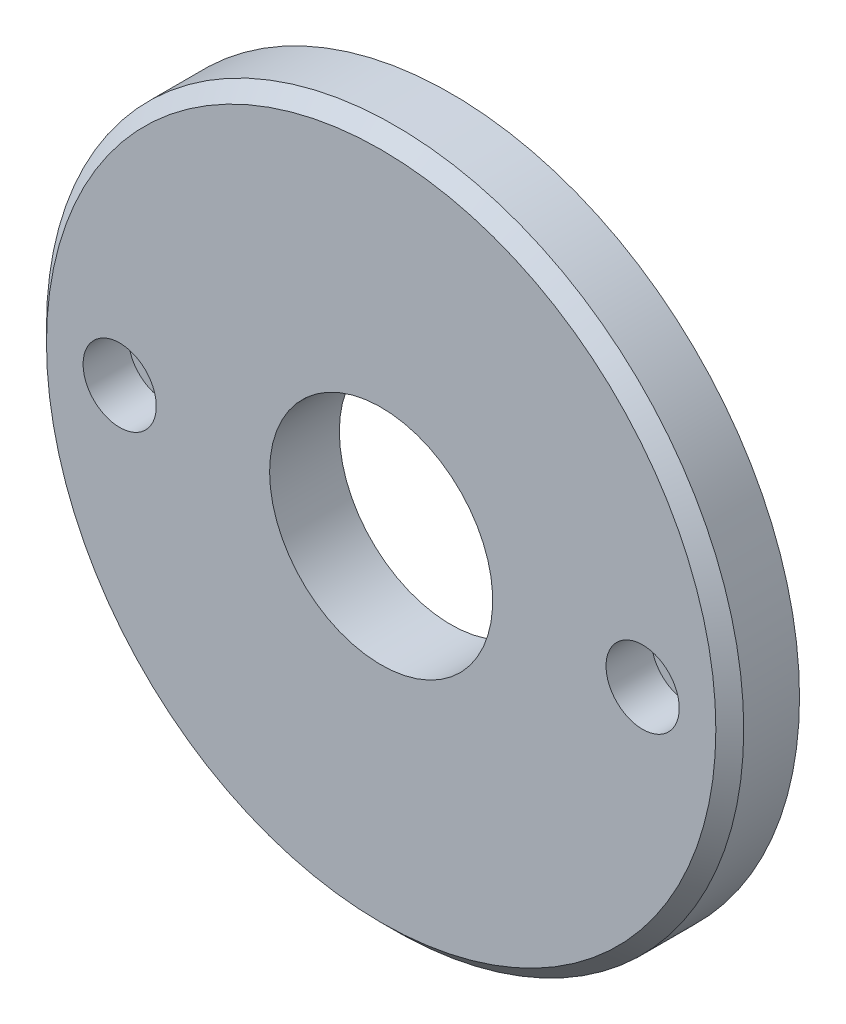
ISO-10303-21;
HEADER;
FILE_DESCRIPTION(('STEP AP214'),'2;1');
FILE_NAME('part.step','',(''),(''),'','','');
FILE_SCHEMA(('AUTOMOTIVE_DESIGN { 1 0 10303 214 1 1 1 1 }'));
ENDSEC;
DATA;
#1=APPLICATION_CONTEXT('core data for automotive mechanical design processes');
#2=APPLICATION_PROTOCOL_DEFINITION('international standard','automotive_design',2000,#1);
#3=PRODUCT_CONTEXT('',#1,'mechanical');
#4=PRODUCT('Part','Part','',(#3));
#5=PRODUCT_RELATED_PRODUCT_CATEGORY('part','',(#4));
#6=PRODUCT_DEFINITION_FORMATION('','',#4);
#7=PRODUCT_DEFINITION_CONTEXT('part definition',#1,'design');
#8=PRODUCT_DEFINITION('design','',#6,#7);
#9=PRODUCT_DEFINITION_SHAPE('','',#8);
#10=(LENGTH_UNIT() NAMED_UNIT(*) SI_UNIT(.MILLI.,.METRE.));
#11=(NAMED_UNIT(*) PLANE_ANGLE_UNIT() SI_UNIT($,.RADIAN.));
#12=(NAMED_UNIT(*) SI_UNIT($,.STERADIAN.) SOLID_ANGLE_UNIT());
#13=UNCERTAINTY_MEASURE_WITH_UNIT(LENGTH_MEASURE(1.E-05),#10,'distance_accuracy_value','');
#14=(GEOMETRIC_REPRESENTATION_CONTEXT(3) GLOBAL_UNCERTAINTY_ASSIGNED_CONTEXT((#13)) GLOBAL_UNIT_ASSIGNED_CONTEXT((#10,
#11,#12)) REPRESENTATION_CONTEXT('',''));
#15=CARTESIAN_POINT('',(0.,0.,0.));
#16=DIRECTION('',(0.,0.,1.));
#17=DIRECTION('',(1.,0.,0.));
#18=AXIS2_PLACEMENT_3D('',#15,#16,#17);
#19=CARTESIAN_POINT('',(0.,0.,70.));
#20=DIRECTION('',(0.,0.,1.));
#21=DIRECTION('',(1.,0.,0.));
#22=AXIS2_PLACEMENT_3D('',#19,#20,#21);
#23=PLANE('',#22);
#24=CARTESIAN_POINT('',(37.5,0.,70.));
#25=DIRECTION('',(0.,0.,-1.));
#26=DIRECTION('',(1.,0.,0.));
#27=AXIS2_PLACEMENT_3D('',#24,#25,#26);
#28=CIRCLE('',#27,5.25);
#29=CARTESIAN_POINT('',(42.75,0.,70.));
#30=VERTEX_POINT('',#29);
#31=EDGE_CURVE('E111',#30,#30,#28,.T.);
#32=ORIENTED_EDGE('',*,*,#31,.T.);
#33=EDGE_LOOP('',(#32));
#34=FACE_BOUND('',#33,.T.);
#35=CARTESIAN_POINT('',(-37.5,0.,70.));
#36=DIRECTION('',(0.,0.,-1.));
#37=DIRECTION('',(-1.,0.,0.));
#38=AXIS2_PLACEMENT_3D('',#35,#36,#37);
#39=CIRCLE('',#38,5.25);
#40=CARTESIAN_POINT('',(-42.75,0.,70.));
#41=VERTEX_POINT('',#40);
#42=EDGE_CURVE('E45',#41,#41,#39,.T.);
#43=ORIENTED_EDGE('',*,*,#42,.T.);
#44=EDGE_LOOP('',(#43));
#45=FACE_BOUND('',#44,.T.);
#46=CARTESIAN_POINT('',(0.,0.,70.));
#47=DIRECTION('',(0.,0.,1.));
#48=DIRECTION('',(1.,0.,0.));
#49=AXIS2_PLACEMENT_3D('',#46,#47,#48);
#50=CIRCLE('',#49,48.);
#51=CARTESIAN_POINT('',(48.,0.,70.));
#52=VERTEX_POINT('',#51);
#53=EDGE_CURVE('E10',#52,#52,#50,.T.);
#54=ORIENTED_EDGE('',*,*,#53,.T.);
#55=EDGE_LOOP('',(#54));
#56=FACE_BOUND('',#55,.T.);
#57=CARTESIAN_POINT('',(0.,0.,70.));
#58=DIRECTION('',(0.,0.,-1.));
#59=DIRECTION('',(-1.,0.,0.));
#60=AXIS2_PLACEMENT_3D('',#57,#58,#59);
#61=CIRCLE('',#60,16.);
#62=CARTESIAN_POINT('',(-16.,0.,70.));
#63=VERTEX_POINT('',#62);
#64=EDGE_CURVE('E32',#63,#63,#61,.T.);
#65=ORIENTED_EDGE('',*,*,#64,.T.);
#66=EDGE_LOOP('',(#65));
#67=FACE_BOUND('',#66,.T.);
#68=ADVANCED_FACE('F14',(#34,#45,#56,#67),#23,.T.);
#69=CARTESIAN_POINT('',(0.,0.,60.));
#70=DIRECTION('',(0.,0.,-1.));
#71=DIRECTION('',(-1.,0.,0.));
#72=AXIS2_PLACEMENT_3D('',#69,#70,#71);
#73=PLANE('',#72);
#74=CARTESIAN_POINT('',(37.5,0.,60.));
#75=DIRECTION('',(0.,0.,-1.));
#76=DIRECTION('',(-1.,0.,0.));
#77=AXIS2_PLACEMENT_3D('',#74,#75,#76);
#78=CIRCLE('',#77,3.25);
#79=CARTESIAN_POINT('',(34.25,0.,60.));
#80=VERTEX_POINT('',#79);
#81=EDGE_CURVE('E18',#80,#80,#78,.T.);
#82=ORIENTED_EDGE('',*,*,#81,.F.);
#83=EDGE_LOOP('',(#82));
#84=FACE_BOUND('',#83,.T.);
#85=CARTESIAN_POINT('',(-37.5,0.,60.));
#86=DIRECTION('',(0.,0.,-1.));
#87=DIRECTION('',(-1.,0.,0.));
#88=AXIS2_PLACEMENT_3D('',#85,#86,#87);
#89=CIRCLE('',#88,3.25);
#90=CARTESIAN_POINT('',(-40.75,0.,60.));
#91=VERTEX_POINT('',#90);
#92=EDGE_CURVE('E30',#91,#91,#89,.T.);
#93=ORIENTED_EDGE('',*,*,#92,.F.);
#94=EDGE_LOOP('',(#93));
#95=FACE_BOUND('',#94,.T.);
#96=CARTESIAN_POINT('',(0.,0.,60.));
#97=DIRECTION('',(0.,0.,-1.));
#98=DIRECTION('',(-1.,0.,0.));
#99=AXIS2_PLACEMENT_3D('',#96,#97,#98);
#100=CIRCLE('',#99,16.);
#101=CARTESIAN_POINT('',(-16.,0.,60.));
#102=VERTEX_POINT('',#101);
#103=EDGE_CURVE('E37',#102,#102,#100,.T.);
#104=ORIENTED_EDGE('',*,*,#103,.F.);
#105=EDGE_LOOP('',(#104));
#106=FACE_BOUND('',#105,.T.);
#107=CARTESIAN_POINT('',(0.,0.,60.));
#108=DIRECTION('',(0.,0.,1.));
#109=DIRECTION('',(1.,0.,0.));
#110=AXIS2_PLACEMENT_3D('',#107,#108,#109);
#111=CIRCLE('',#110,50.);
#112=CARTESIAN_POINT('',(50.,0.,60.));
#113=VERTEX_POINT('',#112);
#114=EDGE_CURVE('E27',#113,#113,#111,.T.);
#115=ORIENTED_EDGE('',*,*,#114,.F.);
#116=EDGE_LOOP('',(#115));
#117=FACE_BOUND('',#116,.T.);
#118=ADVANCED_FACE('F56',(#84,#95,#106,#117),#73,.T.);
#119=CARTESIAN_POINT('',(0.,0.,60.));
#120=DIRECTION('',(0.,0.,1.));
#121=DIRECTION('',(1.,0.,0.));
#122=AXIS2_PLACEMENT_3D('',#119,#120,#121);
#123=CYLINDRICAL_SURFACE('',#122,50.);
#124=CARTESIAN_POINT('',(0.,0.,68.));
#125=DIRECTION('',(0.,0.,1.));
#126=DIRECTION('',(1.,0.,0.));
#127=AXIS2_PLACEMENT_3D('',#124,#125,#126);
#128=CIRCLE('',#127,50.);
#129=CARTESIAN_POINT('',(50.,0.,68.));
#130=VERTEX_POINT('',#129);
#131=EDGE_CURVE('E22',#130,#130,#128,.F.);
#132=ORIENTED_EDGE('',*,*,#131,.T.);
#133=EDGE_LOOP('',(#132));
#134=FACE_BOUND('',#133,.T.);
#135=ORIENTED_EDGE('',*,*,#114,.T.);
#136=EDGE_LOOP('',(#135));
#137=FACE_BOUND('',#136,.T.);
#138=ADVANCED_FACE('F59',(#134,#137),#123,.T.);
#139=CARTESIAN_POINT('',(0.,0.,70.));
#140=DIRECTION('',(0.,0.,-1.));
#141=DIRECTION('',(-1.,0.,0.));
#142=AXIS2_PLACEMENT_3D('',#139,#140,#141);
#143=CYLINDRICAL_SURFACE('',#142,16.);
#144=ORIENTED_EDGE('',*,*,#103,.T.);
#145=EDGE_LOOP('',(#144));
#146=FACE_BOUND('',#145,.T.);
#147=ORIENTED_EDGE('',*,*,#64,.F.);
#148=EDGE_LOOP('',(#147));
#149=FACE_BOUND('',#148,.T.);
#150=ADVANCED_FACE('F53',(#146,#149),#143,.F.);
#151=CARTESIAN_POINT('',(0.,0.,68.));
#152=DIRECTION('',(0.,0.,-1.));
#153=DIRECTION('',(-1.,0.,0.));
#154=AXIS2_PLACEMENT_3D('',#151,#152,#153);
#155=CONICAL_SURFACE('',#154,50.,0.785398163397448);
#156=ORIENTED_EDGE('',*,*,#53,.F.);
#157=EDGE_LOOP('',(#156));
#158=FACE_BOUND('',#157,.T.);
#159=ORIENTED_EDGE('',*,*,#131,.F.);
#160=EDGE_LOOP('',(#159));
#161=FACE_BOUND('',#160,.T.);
#162=ADVANCED_FACE('F16',(#158,#161),#155,.T.);
#163=CARTESIAN_POINT('',(-37.5,0.,-256.997323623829));
#164=DIRECTION('',(0.,0.,-1.));
#165=DIRECTION('',(-1.,0.,0.));
#166=AXIS2_PLACEMENT_3D('',#163,#164,#165);
#167=CYLINDRICAL_SURFACE('',#166,3.25);
#168=ORIENTED_EDGE('',*,*,#92,.T.);
#169=EDGE_LOOP('',(#168));
#170=FACE_BOUND('',#169,.T.);
#171=CARTESIAN_POINT('',(-37.5,0.,63.5));
#172=DIRECTION('',(0.,0.,-1.));
#173=DIRECTION('',(-1.,0.,0.));
#174=AXIS2_PLACEMENT_3D('',#171,#172,#173);
#175=CIRCLE('',#174,3.25);
#176=CARTESIAN_POINT('',(-40.75,0.,63.5));
#177=VERTEX_POINT('',#176);
#178=EDGE_CURVE('E33',#177,#177,#175,.T.);
#179=ORIENTED_EDGE('',*,*,#178,.F.);
#180=EDGE_LOOP('',(#179));
#181=FACE_BOUND('',#180,.T.);
#182=ADVANCED_FACE('F87',(#170,#181),#167,.F.);
#183=CARTESIAN_POINT('',(-37.5,0.,63.5));
#184=DIRECTION('',(0.,0.,-1.));
#185=DIRECTION('',(-1.,0.,0.));
#186=AXIS2_PLACEMENT_3D('',#183,#184,#185);
#187=PLANE('',#186);
#188=ORIENTED_EDGE('',*,*,#178,.T.);
#189=EDGE_LOOP('',(#188));
#190=FACE_BOUND('',#189,.T.);
#191=CARTESIAN_POINT('',(-37.5,0.,63.5));
#192=DIRECTION('',(0.,0.,-1.));
#193=DIRECTION('',(-1.,0.,0.));
#194=AXIS2_PLACEMENT_3D('',#191,#192,#193);
#195=CIRCLE('',#194,5.25);
#196=CARTESIAN_POINT('',(-42.75,0.,63.5));
#197=VERTEX_POINT('',#196);
#198=EDGE_CURVE('E40',#197,#197,#195,.T.);
#199=ORIENTED_EDGE('',*,*,#198,.F.);
#200=EDGE_LOOP('',(#199));
#201=FACE_BOUND('',#200,.T.);
#202=ADVANCED_FACE('F83',(#190,#201),#187,.F.);
#203=CARTESIAN_POINT('',(-37.5,0.,70.));
#204=DIRECTION('',(0.,0.,-1.));
#205=DIRECTION('',(-1.,0.,0.));
#206=AXIS2_PLACEMENT_3D('',#203,#204,#205);
#207=CYLINDRICAL_SURFACE('',#206,5.25);
#208=ORIENTED_EDGE('',*,*,#198,.T.);
#209=EDGE_LOOP('',(#208));
#210=FACE_BOUND('',#209,.T.);
#211=ORIENTED_EDGE('',*,*,#42,.F.);
#212=EDGE_LOOP('',(#211));
#213=FACE_BOUND('',#212,.T.);
#214=ADVANCED_FACE('F79',(#210,#213),#207,.F.);
#215=CARTESIAN_POINT('',(37.5,0.,-256.997323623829));
#216=DIRECTION('',(0.,0.,-1.));
#217=DIRECTION('',(1.,0.,0.));
#218=AXIS2_PLACEMENT_3D('',#215,#216,#217);
#219=CYLINDRICAL_SURFACE('',#218,3.25);
#220=ORIENTED_EDGE('',*,*,#81,.T.);
#221=EDGE_LOOP('',(#220));
#222=FACE_BOUND('',#221,.T.);
#223=CARTESIAN_POINT('',(37.5,0.,63.5));
#224=DIRECTION('',(0.,0.,-1.));
#225=DIRECTION('',(1.,0.,0.));
#226=AXIS2_PLACEMENT_3D('',#223,#224,#225);
#227=CIRCLE('',#226,3.25);
#228=CARTESIAN_POINT('',(40.75,0.,63.5));
#229=VERTEX_POINT('',#228);
#230=EDGE_CURVE('E107',#229,#229,#227,.T.);
#231=ORIENTED_EDGE('',*,*,#230,.F.);
#232=EDGE_LOOP('',(#231));
#233=FACE_BOUND('',#232,.T.);
#234=ADVANCED_FACE('F82',(#222,#233),#219,.F.);
#235=CARTESIAN_POINT('',(37.5,0.,63.5));
#236=DIRECTION('',(0.,0.,-1.));
#237=DIRECTION('',(1.,0.,0.));
#238=AXIS2_PLACEMENT_3D('',#235,#236,#237);
#239=PLANE('',#238);
#240=ORIENTED_EDGE('',*,*,#230,.T.);
#241=EDGE_LOOP('',(#240));
#242=FACE_BOUND('',#241,.T.);
#243=CARTESIAN_POINT('',(37.5,0.,63.5));
#244=DIRECTION('',(0.,0.,-1.));
#245=DIRECTION('',(1.,0.,0.));
#246=AXIS2_PLACEMENT_3D('',#243,#244,#245);
#247=CIRCLE('',#246,5.25);
#248=CARTESIAN_POINT('',(42.75,0.,63.5));
#249=VERTEX_POINT('',#248);
#250=EDGE_CURVE('E108',#249,#249,#247,.T.);
#251=ORIENTED_EDGE('',*,*,#250,.F.);
#252=EDGE_LOOP('',(#251));
#253=FACE_BOUND('',#252,.T.);
#254=ADVANCED_FACE('F93',(#242,#253),#239,.F.);
#255=CARTESIAN_POINT('',(37.5,0.,70.));
#256=DIRECTION('',(0.,0.,-1.));
#257=DIRECTION('',(1.,0.,0.));
#258=AXIS2_PLACEMENT_3D('',#255,#256,#257);
#259=CYLINDRICAL_SURFACE('',#258,5.25);
#260=ORIENTED_EDGE('',*,*,#250,.T.);
#261=EDGE_LOOP('',(#260));
#262=FACE_BOUND('',#261,.T.);
#263=ORIENTED_EDGE('',*,*,#31,.F.);
#264=EDGE_LOOP('',(#263));
#265=FACE_BOUND('',#264,.T.);
#266=ADVANCED_FACE('F90',(#262,#265),#259,.F.);
#267=CLOSED_SHELL('',(#68,#118,#138,#150,#162,#182,#202,#214,#234,#254,#266));
#268=MANIFOLD_SOLID_BREP('B1',#267);
#269=ADVANCED_BREP_SHAPE_REPRESENTATION('',(#18,#268),#14);
#270=SHAPE_DEFINITION_REPRESENTATION(#9,#269);
ENDSEC;
END-ISO-10303-21;
